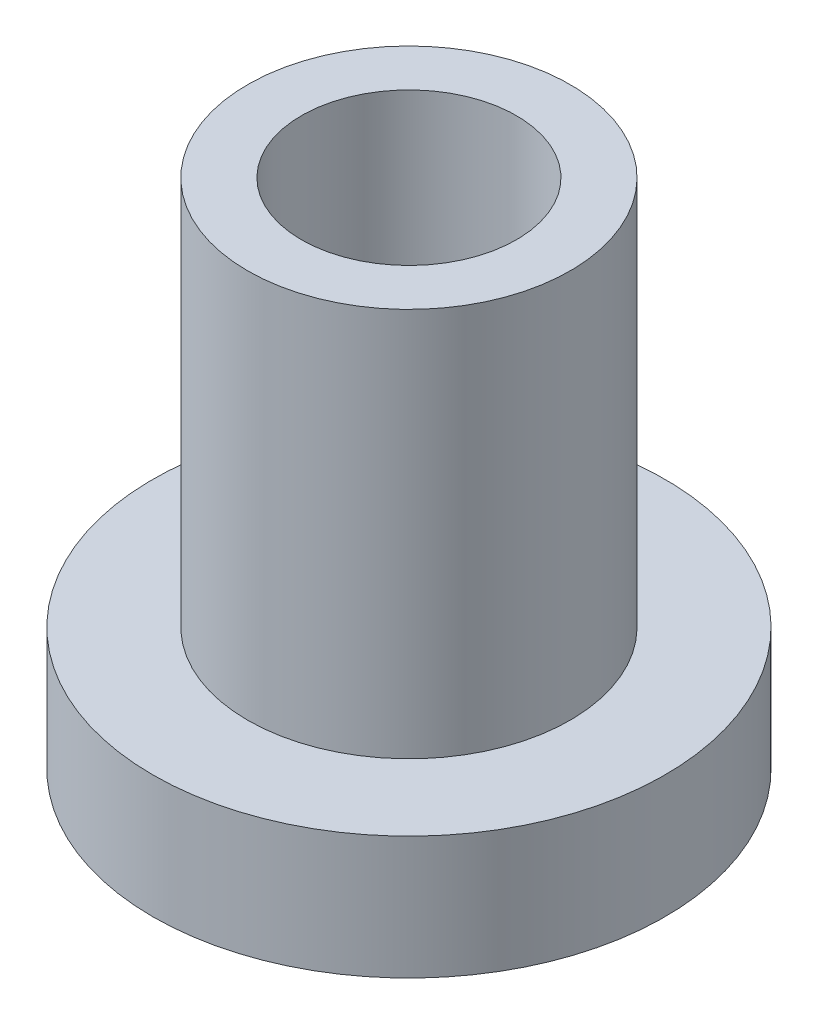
ISO-10303-21;
HEADER;
FILE_DESCRIPTION(('STEP AP214'),'2;1');
FILE_NAME('part.step','',(''),(''),'','','');
FILE_SCHEMA(('AUTOMOTIVE_DESIGN { 1 0 10303 214 1 1 1 1 }'));
ENDSEC;
DATA;
#1=APPLICATION_CONTEXT('core data for automotive mechanical design processes');
#2=APPLICATION_PROTOCOL_DEFINITION('international standard','automotive_design',2000,#1);
#3=PRODUCT_CONTEXT('',#1,'mechanical');
#4=PRODUCT('Part','Part','',(#3));
#5=PRODUCT_RELATED_PRODUCT_CATEGORY('part','',(#4));
#6=PRODUCT_DEFINITION_FORMATION('','',#4);
#7=PRODUCT_DEFINITION_CONTEXT('part definition',#1,'design');
#8=PRODUCT_DEFINITION('design','',#6,#7);
#9=PRODUCT_DEFINITION_SHAPE('','',#8);
#10=(LENGTH_UNIT() NAMED_UNIT(*) SI_UNIT(.MILLI.,.METRE.));
#11=(NAMED_UNIT(*) PLANE_ANGLE_UNIT() SI_UNIT($,.RADIAN.));
#12=(NAMED_UNIT(*) SI_UNIT($,.STERADIAN.) SOLID_ANGLE_UNIT());
#13=UNCERTAINTY_MEASURE_WITH_UNIT(LENGTH_MEASURE(1.E-05),#10,'distance_accuracy_value','');
#14=(GEOMETRIC_REPRESENTATION_CONTEXT(3) GLOBAL_UNCERTAINTY_ASSIGNED_CONTEXT((#13)) GLOBAL_UNIT_ASSIGNED_CONTEXT((#10,
#11,#12)) REPRESENTATION_CONTEXT('',''));
#15=CARTESIAN_POINT('',(0.,0.,0.));
#16=DIRECTION('',(0.,0.,1.));
#17=DIRECTION('',(1.,0.,0.));
#18=AXIS2_PLACEMENT_3D('',#15,#16,#17);
#19=CARTESIAN_POINT('',(-2.56739074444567E-13,0.,0.));
#20=DIRECTION('',(0.,1.,0.));
#21=DIRECTION('',(0.,0.,1.));
#22=AXIS2_PLACEMENT_3D('',#19,#20,#21);
#23=CYLINDRICAL_SURFACE('',#22,6.35);
#24=CARTESIAN_POINT('',(-2.56739074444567E-13,3.048,0.));
#25=DIRECTION('',(0.,1.,0.));
#26=DIRECTION('',(0.,0.,1.));
#27=AXIS2_PLACEMENT_3D('',#24,#25,#26);
#28=CIRCLE('',#27,6.35);
#29=CARTESIAN_POINT('',(-2.55681587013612E-13,3.04799999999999,6.35));
#30=VERTEX_POINT('',#29);
#31=EDGE_CURVE('E46',#30,#30,#28,.T.);
#32=ORIENTED_EDGE('',*,*,#31,.F.);
#33=EDGE_LOOP('',(#32));
#34=FACE_BOUND('',#33,.T.);
#35=CARTESIAN_POINT('',(-2.56739074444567E-13,0.,0.));
#36=DIRECTION('',(0.,1.,0.));
#37=DIRECTION('',(0.,0.,1.));
#38=AXIS2_PLACEMENT_3D('',#35,#36,#37);
#39=CIRCLE('',#38,6.35);
#40=CARTESIAN_POINT('',(-2.55681587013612E-13,0.,6.35000000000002));
#41=VERTEX_POINT('',#40);
#42=EDGE_CURVE('E10',#41,#41,#39,.T.);
#43=ORIENTED_EDGE('',*,*,#42,.T.);
#44=EDGE_LOOP('',(#43));
#45=FACE_BOUND('',#44,.T.);
#46=ADVANCED_FACE('F24',(#34,#45),#23,.T.);
#47=CARTESIAN_POINT('',(-3.33066907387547E-13,0.,-2.66700000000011));
#48=DIRECTION('',(0.,1.,0.));
#49=DIRECTION('',(0.,0.,1.));
#50=AXIS2_PLACEMENT_3D('',#47,#48,#49);
#51=PLANE('',#50);
#52=ORIENTED_EDGE('',*,*,#42,.F.);
#53=EDGE_LOOP('',(#52));
#54=FACE_BOUND('',#53,.T.);
#55=CARTESIAN_POINT('',(-2.56739074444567E-13,0.,0.));
#56=DIRECTION('',(0.,1.,0.));
#57=DIRECTION('',(0.,0.,1.));
#58=AXIS2_PLACEMENT_3D('',#55,#56,#57);
#59=CIRCLE('',#58,2.667);
#60=CARTESIAN_POINT('',(-2.56294929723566E-13,0.,2.66700000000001));
#61=VERTEX_POINT('',#60);
#62=EDGE_CURVE('E30',#61,#61,#59,.T.);
#63=ORIENTED_EDGE('',*,*,#62,.T.);
#64=EDGE_LOOP('',(#63));
#65=FACE_BOUND('',#64,.T.);
#66=ADVANCED_FACE('F53',(#54,#65),#51,.F.);
#67=CARTESIAN_POINT('',(-2.56739074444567E-13,0.,0.));
#68=DIRECTION('',(0.,1.,0.));
#69=DIRECTION('',(0.,0.,1.));
#70=AXIS2_PLACEMENT_3D('',#67,#68,#69);
#71=CYLINDRICAL_SURFACE('',#70,2.667);
#72=ORIENTED_EDGE('',*,*,#62,.F.);
#73=EDGE_LOOP('',(#72));
#74=FACE_BOUND('',#73,.T.);
#75=CARTESIAN_POINT('',(0.,12.6999999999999,0.));
#76=DIRECTION('',(0.,1.,0.));
#77=DIRECTION('',(0.,0.,1.));
#78=AXIS2_PLACEMENT_3D('',#75,#76,#77);
#79=CIRCLE('',#78,2.667);
#80=CARTESIAN_POINT('',(0.,12.6999999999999,2.66700000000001));
#81=VERTEX_POINT('',#80);
#82=EDGE_CURVE('E34',#81,#81,#79,.T.);
#83=ORIENTED_EDGE('',*,*,#82,.T.);
#84=EDGE_LOOP('',(#83));
#85=FACE_BOUND('',#84,.T.);
#86=ADVANCED_FACE('F57',(#74,#85),#71,.F.);
#87=CARTESIAN_POINT('',(-3.60822483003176E-13,12.6999999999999,-4.00049999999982));
#88=DIRECTION('',(0.,-1.,0.));
#89=DIRECTION('',(0.,0.,-1.));
#90=AXIS2_PLACEMENT_3D('',#87,#88,#89);
#91=PLANE('',#90);
#92=ORIENTED_EDGE('',*,*,#82,.F.);
#93=EDGE_LOOP('',(#92));
#94=FACE_BOUND('',#93,.T.);
#95=CARTESIAN_POINT('',(0.,12.6999999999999,0.));
#96=DIRECTION('',(0.,1.,0.));
#97=DIRECTION('',(0.,0.,1.));
#98=AXIS2_PLACEMENT_3D('',#95,#96,#97);
#99=CIRCLE('',#98,4.0005);
#100=CARTESIAN_POINT('',(0.,12.6999999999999,4.00050000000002));
#101=VERTEX_POINT('',#100);
#102=EDGE_CURVE('E38',#101,#101,#99,.T.);
#103=ORIENTED_EDGE('',*,*,#102,.T.);
#104=EDGE_LOOP('',(#103));
#105=FACE_BOUND('',#104,.T.);
#106=ADVANCED_FACE('F62',(#94,#105),#91,.F.);
#107=CARTESIAN_POINT('',(-2.56739074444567E-13,0.,0.));
#108=DIRECTION('',(0.,1.,0.));
#109=DIRECTION('',(0.,0.,1.));
#110=AXIS2_PLACEMENT_3D('',#107,#108,#109);
#111=CYLINDRICAL_SURFACE('',#110,4.0005);
#112=ORIENTED_EDGE('',*,*,#102,.F.);
#113=EDGE_LOOP('',(#112));
#114=FACE_BOUND('',#113,.T.);
#115=CARTESIAN_POINT('',(-2.56739074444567E-13,3.048,0.));
#116=DIRECTION('',(0.,1.,0.));
#117=DIRECTION('',(0.,0.,1.));
#118=AXIS2_PLACEMENT_3D('',#115,#116,#117);
#119=CIRCLE('',#118,4.0005);
#120=CARTESIAN_POINT('',(-2.56072857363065E-13,3.04799999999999,4.0005));
#121=VERTEX_POINT('',#120);
#122=EDGE_CURVE('E43',#121,#121,#119,.T.);
#123=ORIENTED_EDGE('',*,*,#122,.T.);
#124=EDGE_LOOP('',(#123));
#125=FACE_BOUND('',#124,.T.);
#126=ADVANCED_FACE('F68',(#114,#125),#111,.T.);
#127=CARTESIAN_POINT('',(-2.84494650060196E-13,3.04799999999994,-6.34999999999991));
#128=DIRECTION('',(0.,-1.,0.));
#129=DIRECTION('',(0.,0.,-1.));
#130=AXIS2_PLACEMENT_3D('',#127,#128,#129);
#131=PLANE('',#130);
#132=ORIENTED_EDGE('',*,*,#122,.F.);
#133=EDGE_LOOP('',(#132));
#134=FACE_BOUND('',#133,.T.);
#135=ORIENTED_EDGE('',*,*,#31,.T.);
#136=EDGE_LOOP('',(#135));
#137=FACE_BOUND('',#136,.T.);
#138=ADVANCED_FACE('F50',(#134,#137),#131,.F.);
#139=CLOSED_SHELL('',(#46,#66,#86,#106,#126,#138));
#140=MANIFOLD_SOLID_BREP('B2',#139);
#141=ADVANCED_BREP_SHAPE_REPRESENTATION('',(#18,#140),#14);
#142=SHAPE_DEFINITION_REPRESENTATION(#9,#141);
ENDSEC;
END-ISO-10303-21;
